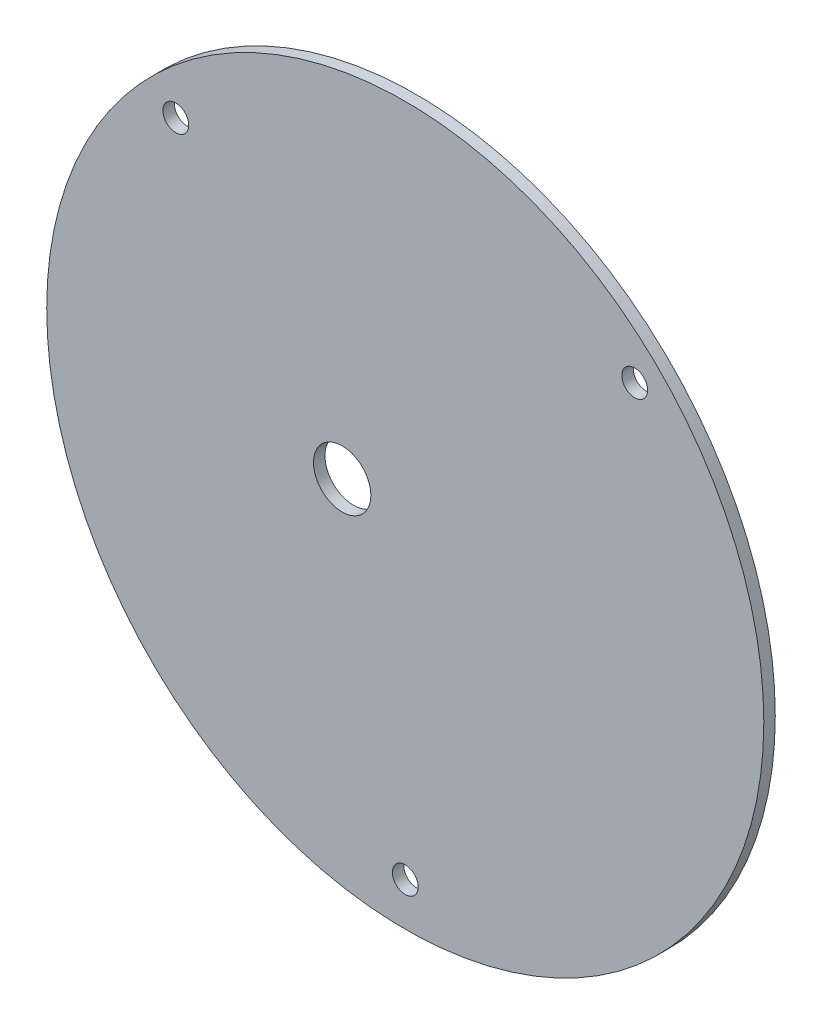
from build123d import *

# Parameters (mm, degrees)
SCHIZZO1_R                   = 125
SCHIZZO1_R_2                 = 4.5
SCHIZZO1_R_3                 = 10
ESTRUSIONE_ESTRUSIONE1_DEPTH = 4


with BuildPart() as part:
    # Schizzo1 → Estrusione-Estrusione1 (new body)
    with BuildSketch(Plane.XY):
        Circle(SCHIZZO1_R)
        with Locations((80, 80)):
            Circle(SCHIZZO1_R_2, mode=Mode.SUBTRACT)
        with Locations((-80, 80)):
            Circle(SCHIZZO1_R_2, mode=Mode.SUBTRACT)
        with Locations((0, -110)):
            Circle(SCHIZZO1_R_2, mode=Mode.SUBTRACT)
        with Locations((-22, 0)):
            Circle(SCHIZZO1_R_3, mode=Mode.SUBTRACT)
    extrude(amount=ESTRUSIONE_ESTRUSIONE1_DEPTH)


solid = part.part
